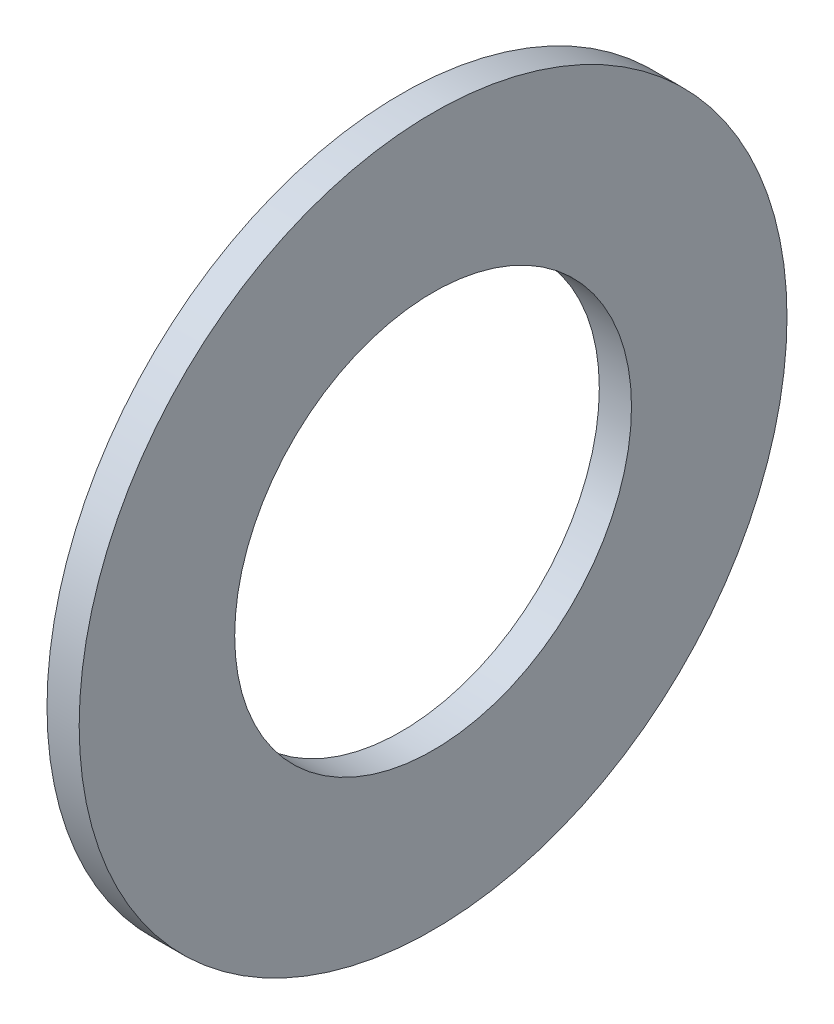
ISO-10303-21;
HEADER;
FILE_DESCRIPTION(('STEP AP214'),'2;1');
FILE_NAME('part.step','',(''),(''),'','','');
FILE_SCHEMA(('AUTOMOTIVE_DESIGN { 1 0 10303 214 1 1 1 1 }'));
ENDSEC;
DATA;
#1=APPLICATION_CONTEXT('core data for automotive mechanical design processes');
#2=APPLICATION_PROTOCOL_DEFINITION('international standard','automotive_design',2000,#1);
#3=PRODUCT_CONTEXT('',#1,'mechanical');
#4=PRODUCT('Part','Part','',(#3));
#5=PRODUCT_RELATED_PRODUCT_CATEGORY('part','',(#4));
#6=PRODUCT_DEFINITION_FORMATION('','',#4);
#7=PRODUCT_DEFINITION_CONTEXT('part definition',#1,'design');
#8=PRODUCT_DEFINITION('design','',#6,#7);
#9=PRODUCT_DEFINITION_SHAPE('','',#8);
#10=(LENGTH_UNIT() NAMED_UNIT(*) SI_UNIT(.MILLI.,.METRE.));
#11=(NAMED_UNIT(*) PLANE_ANGLE_UNIT() SI_UNIT($,.RADIAN.));
#12=(NAMED_UNIT(*) SI_UNIT($,.STERADIAN.) SOLID_ANGLE_UNIT());
#13=UNCERTAINTY_MEASURE_WITH_UNIT(LENGTH_MEASURE(1.E-05),#10,'distance_accuracy_value','');
#14=(GEOMETRIC_REPRESENTATION_CONTEXT(3) GLOBAL_UNCERTAINTY_ASSIGNED_CONTEXT((#13)) GLOBAL_UNIT_ASSIGNED_CONTEXT((#10,
#11,#12)) REPRESENTATION_CONTEXT('',''));
#15=CARTESIAN_POINT('',(0.,0.,0.));
#16=DIRECTION('',(0.,0.,1.));
#17=DIRECTION('',(1.,0.,0.));
#18=AXIS2_PLACEMENT_3D('',#15,#16,#17);
#19=CARTESIAN_POINT('',(-34.9249999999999,0.,0.));
#20=DIRECTION('',(-1.,0.,0.));
#21=DIRECTION('',(0.,0.,1.));
#22=AXIS2_PLACEMENT_3D('',#19,#20,#21);
#23=CYLINDRICAL_SURFACE('',#22,18.5);
#24=CARTESIAN_POINT('',(0.,0.,0.));
#25=DIRECTION('',(-1.,0.,0.));
#26=DIRECTION('',(0.,0.,1.));
#27=AXIS2_PLACEMENT_3D('',#24,#25,#26);
#28=CIRCLE('',#27,18.5);
#29=CARTESIAN_POINT('',(0.,0.,18.5));
#30=VERTEX_POINT('',#29);
#31=EDGE_CURVE('E10',#30,#30,#28,.T.);
#32=ORIENTED_EDGE('',*,*,#31,.F.);
#33=EDGE_LOOP('',(#32));
#34=FACE_BOUND('',#33,.T.);
#35=CARTESIAN_POINT('',(-3.,0.,0.));
#36=DIRECTION('',(-1.,0.,0.));
#37=DIRECTION('',(0.,0.,1.));
#38=AXIS2_PLACEMENT_3D('',#35,#36,#37);
#39=CIRCLE('',#38,18.5);
#40=CARTESIAN_POINT('',(-3.,0.,18.5));
#41=VERTEX_POINT('',#40);
#42=EDGE_CURVE('E51',#41,#41,#39,.T.);
#43=ORIENTED_EDGE('',*,*,#42,.T.);
#44=EDGE_LOOP('',(#43));
#45=FACE_BOUND('',#44,.T.);
#46=ADVANCED_FACE('F37',(#34,#45),#23,.F.);
#47=CARTESIAN_POINT('',(0.,18.5,0.));
#48=DIRECTION('',(-1.,0.,0.));
#49=DIRECTION('',(0.,0.,1.));
#50=AXIS2_PLACEMENT_3D('',#47,#48,#49);
#51=PLANE('',#50);
#52=CARTESIAN_POINT('',(0.,0.,0.));
#53=DIRECTION('',(-1.,0.,0.));
#54=DIRECTION('',(0.,0.,1.));
#55=AXIS2_PLACEMENT_3D('',#52,#53,#54);
#56=CIRCLE('',#55,33.);
#57=CARTESIAN_POINT('',(0.,0.,33.));
#58=VERTEX_POINT('',#57);
#59=EDGE_CURVE('E43',#58,#58,#56,.T.);
#60=ORIENTED_EDGE('',*,*,#59,.F.);
#61=EDGE_LOOP('',(#60));
#62=FACE_BOUND('',#61,.T.);
#63=ORIENTED_EDGE('',*,*,#31,.T.);
#64=EDGE_LOOP('',(#63));
#65=FACE_BOUND('',#64,.T.);
#66=ADVANCED_FACE('F66',(#62,#65),#51,.F.);
#67=CARTESIAN_POINT('',(-34.9249999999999,0.,0.));
#68=DIRECTION('',(-1.,0.,0.));
#69=DIRECTION('',(0.,0.,1.));
#70=AXIS2_PLACEMENT_3D('',#67,#68,#69);
#71=CYLINDRICAL_SURFACE('',#70,33.);
#72=CARTESIAN_POINT('',(-3.,0.,0.));
#73=DIRECTION('',(-1.,0.,0.));
#74=DIRECTION('',(0.,0.,1.));
#75=AXIS2_PLACEMENT_3D('',#72,#73,#74);
#76=CIRCLE('',#75,33.);
#77=CARTESIAN_POINT('',(-3.,0.,33.));
#78=VERTEX_POINT('',#77);
#79=EDGE_CURVE('E47',#78,#78,#76,.T.);
#80=ORIENTED_EDGE('',*,*,#79,.F.);
#81=EDGE_LOOP('',(#80));
#82=FACE_BOUND('',#81,.T.);
#83=ORIENTED_EDGE('',*,*,#59,.T.);
#84=EDGE_LOOP('',(#83));
#85=FACE_BOUND('',#84,.T.);
#86=ADVANCED_FACE('F61',(#82,#85),#71,.T.);
#87=CARTESIAN_POINT('',(-3.,33.,0.));
#88=DIRECTION('',(1.,0.,0.));
#89=DIRECTION('',(0.,0.,-1.));
#90=AXIS2_PLACEMENT_3D('',#87,#88,#89);
#91=PLANE('',#90);
#92=ORIENTED_EDGE('',*,*,#42,.F.);
#93=EDGE_LOOP('',(#92));
#94=FACE_BOUND('',#93,.T.);
#95=ORIENTED_EDGE('',*,*,#79,.T.);
#96=EDGE_LOOP('',(#95));
#97=FACE_BOUND('',#96,.T.);
#98=ADVANCED_FACE('F58',(#94,#97),#91,.F.);
#99=CLOSED_SHELL('',(#46,#66,#86,#98));
#100=MANIFOLD_SOLID_BREP('B2',#99);
#101=ADVANCED_BREP_SHAPE_REPRESENTATION('',(#18,#100),#14);
#102=SHAPE_DEFINITION_REPRESENTATION(#9,#101);
ENDSEC;
END-ISO-10303-21;
